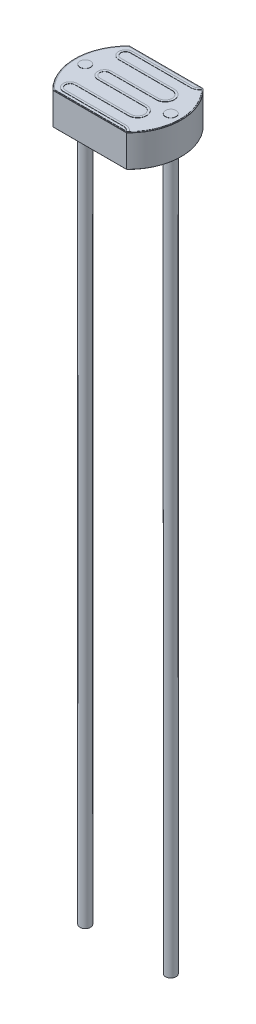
from build123d import *
from build123d.topology import SkipClean

# Parameters (mm, degrees)
BOSS_EXTRUDE1_DEPTH      = 1.5
BOSS_EXTRUDE2_DEPTH      = 0.01
BOSS_EXTRUDE3_DEPTH      = 0.01
BOSS_EXTRUDE4_DEPTH      = 0.01
BOSS_EXTRUDE4_DEPTH_BACK = 35
SKETCH4_R                = 0.25
FILLET1_R                = 0.01


with BuildPart() as part:
    # Sketch1 → Boss-Extrude1 (new body)
    with BuildSketch(Plane(origin=(0, 0, 0), x_dir=(1, 0, 0), z_dir=(0, 1, 0))):
        with BuildLine():
            Line((-1.734935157, 1.8), (1.734935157, 1.8))
            ThreePointArc((1.734935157, 1.8), (2.5, 0), (1.734935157, -1.8))
            Line((1.734935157, -1.8), (-1.734935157, -1.8))
            ThreePointArc((-1.734935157, -1.8), (-2.5, 0), (-1.734935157, 1.8))
        make_face()
    extrude(amount=BOSS_EXTRUDE1_DEPTH)

    # Sketch2 → Boss-Extrude2 (add)
    with BuildSketch(Plane(origin=(0, 1.5, 0), x_dir=(1, 0, 0), z_dir=(0, 1, 0))):
        with BuildLine():
            Line((-1.71464282, -1.75), (1.71464282, -1.75))
            ThreePointArc((1.71464282, -1.75), (2.45, 0), (1.71464282, 1.75))
            Line((1.71464282, 1.75), (-1.71464282, 1.75))
            ThreePointArc((-1.71464282, 1.75), (-2.45, 0), (-1.71464282, -1.75))
        make_face()
    extrude(amount=BOSS_EXTRUDE2_DEPTH)

    # Sketch3 → Boss-Extrude3 (add)
    with SkipClean():  # the faces are left unmerged after this step: merging them gives an invalid solid
        with BuildSketch(Plane(origin=(0, 1.51, 0), x_dir=(1, 0, 0), z_dir=(0, 1, 0))):
            with BuildLine():
                Line((-1.100223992, 0.325), (1.100223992, 0.325))
                ThreePointArc((1.100223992, 0.325), (1.425223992, 0.65), (1.100223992, 0.975))
                Line((1.100223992, 0.975), (-1.100223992, 0.975))
                Line((-1.100223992, 0.975), (-1.415621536, 0.975))
                ThreePointArc((-1.415621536, 0.975), (-1.740621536, 1.3), (-1.415621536, 1.625))
                Line((-1.415621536, 1.625), (1.100223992, 1.625))
                Line((1.100223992, 1.625), (1.414873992, 1.625))
                ThreePointArc((1.414873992, 1.625), (1.55739592, 1.657916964), (1.671047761, 1.75))
                Line((1.671047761, 1.75), (1.71464282, 1.75))
                ThreePointArc((1.71464282, 1.75), (1.737970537, 1.726834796), (1.760985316, 1.703358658))
                ThreePointArc((1.760985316, 1.703358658), (1.609556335, 1.572211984), (1.414873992, 1.525))
                Line((1.414873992, 1.525), (1.100223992, 1.525))
                Line((1.100223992, 1.525), (-1.415621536, 1.525))
                ThreePointArc((-1.415621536, 1.525), (-1.640621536, 1.3), (-1.415621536, 1.075))
                Line((-1.415621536, 1.075), (-1.100223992, 1.075))
                Line((-1.100223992, 1.075), (1.100223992, 1.075))
                ThreePointArc((1.100223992, 1.075), (1.525223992, 0.65), (1.100223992, 0.225))
                Line((1.100223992, 0.225), (-1.100223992, 0.225))
                ThreePointArc((-1.100223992, 0.225), (-1.325223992, 0), (-1.100223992, -0.225))
                Line((-1.100223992, -0.225), (1.100223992, -0.225))
                ThreePointArc((1.100223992, -0.225), (1.525223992, -0.65), (1.100223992, -1.075))
                Line((1.100223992, -1.075), (-1.100223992, -1.075))
                Line((-1.100223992, -1.075), (-1.415621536, -1.075))
                ThreePointArc((-1.415621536, -1.075), (-1.640621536, -1.3), (-1.415621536, -1.525))
                Line((-1.415621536, -1.525), (1.100223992, -1.525))
                Line((1.100223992, -1.525), (1.414873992, -1.525))
                ThreePointArc((1.414873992, -1.525), (1.609556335, -1.572211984), (1.760985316, -1.703358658))
                ThreePointArc((1.760985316, -1.703358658), (1.737970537, -1.726834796), (1.71464282, -1.75))
                Line((1.71464282, -1.75), (1.671047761, -1.75))
                ThreePointArc((1.671047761, -1.75), (1.55739592, -1.657916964), (1.414873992, -1.625))
                Line((1.414873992, -1.625), (1.100223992, -1.625))
                Line((1.100223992, -1.625), (-1.415621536, -1.625))
                ThreePointArc((-1.415621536, -1.625), (-1.740621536, -1.3), (-1.415621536, -0.975))
                Line((-1.415621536, -0.975), (-1.100223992, -0.975))
                Line((-1.100223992, -0.975), (1.100223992, -0.975))
                ThreePointArc((1.100223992, -0.975), (1.425223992, -0.65), (1.100223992, -0.325))
                Line((1.100223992, -0.325), (-1.100223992, -0.325))
                ThreePointArc((-1.100223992, -0.325), (-1.425223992, 0), (-1.100223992, 0.325))
            make_face()
        extrude(amount=BOSS_EXTRUDE3_DEPTH)

    # Sketch4 → Boss-Extrude4 (add, two sides: drawn at the far end of the back side and taken through both)
    with SkipClean():  # the faces are left unmerged after this step: merging them gives an invalid solid
        with BuildSketch(Plane(origin=(0, 1.51, 0), x_dir=(1, 0, 0), z_dir=(0, 1, 0)).offset(-BOSS_EXTRUDE4_DEPTH_BACK)):
            with Locations(Location((-2.009742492, 0, 0), (0, 0, 270))):
                Circle(SKETCH4_R)
            with Locations(Location((2.009742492, 0, 0), (0, 0, 270))):
                Circle(SKETCH4_R)
        extrude(amount=BOSS_EXTRUDE4_DEPTH + BOSS_EXTRUDE4_DEPTH_BACK)

    # Fillet1
    fillet1_edges = [part.edges().sort_by_distance(p)[0] for p in [
        (2.5, 1.5, 0),
        (0, 1.5, -1.8),
        (-2.5, 1.5, 0),
        (0, 0, -1.8),
        (2.5, 0, 0),
        (0, 0, 1.8),
        (-2.5, 0, 0),
        (0, 1.5, 1.8),
        (1.734935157, 0.75, -1.8),
        (1.734935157, 0.75, 1.8),
        (-1.734935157, 0.75, 1.8),
    ]]
    fillet(fillet1_edges, radius=FILLET1_R)


solid = part.part
